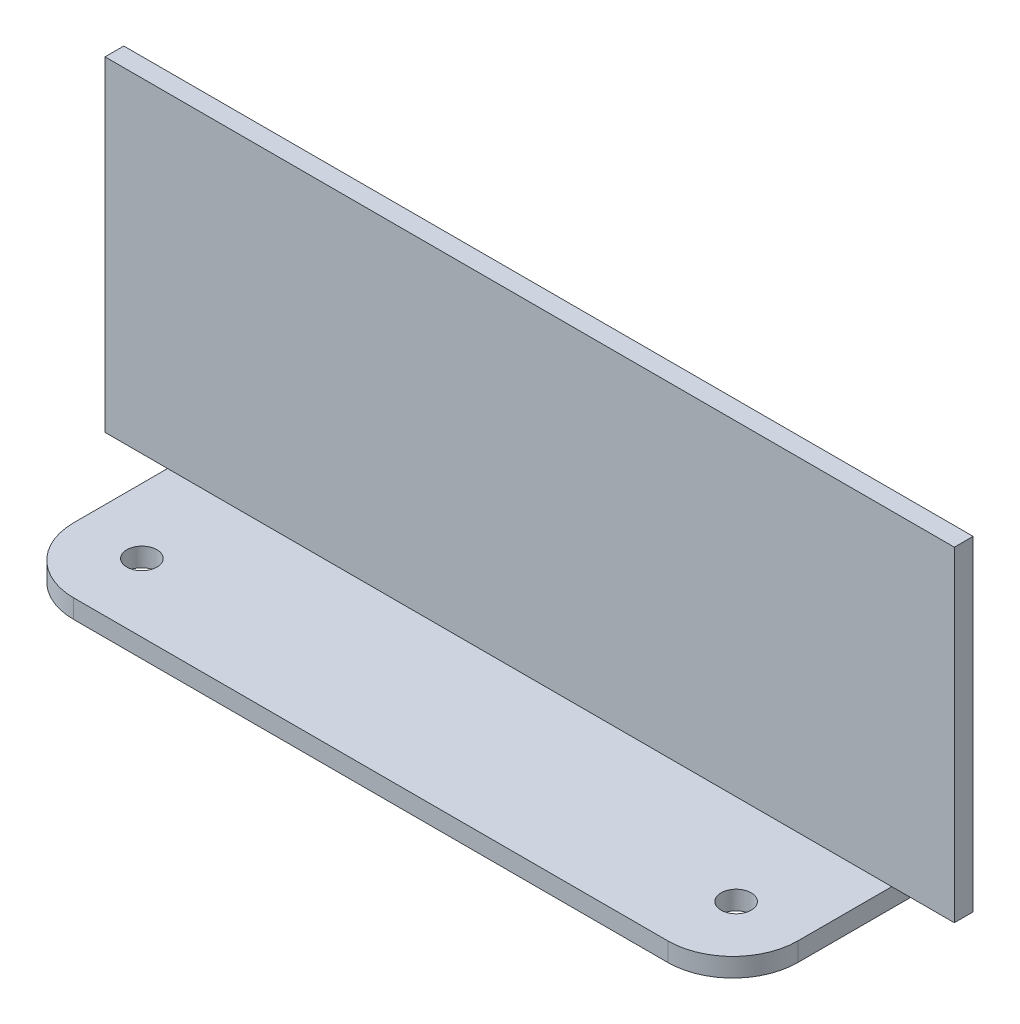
ISO-10303-21;
HEADER;
FILE_DESCRIPTION(('STEP AP214'),'2;1');
FILE_NAME('part.step','',(''),(''),'','','');
FILE_SCHEMA(('AUTOMOTIVE_DESIGN { 1 0 10303 214 1 1 1 1 }'));
ENDSEC;
DATA;
#1=APPLICATION_CONTEXT('core data for automotive mechanical design processes');
#2=APPLICATION_PROTOCOL_DEFINITION('international standard','automotive_design',2000,#1);
#3=PRODUCT_CONTEXT('',#1,'mechanical');
#4=PRODUCT('Part','Part','',(#3));
#5=PRODUCT_RELATED_PRODUCT_CATEGORY('part','',(#4));
#6=PRODUCT_DEFINITION_FORMATION('','',#4);
#7=PRODUCT_DEFINITION_CONTEXT('part definition',#1,'design');
#8=PRODUCT_DEFINITION('design','',#6,#7);
#9=PRODUCT_DEFINITION_SHAPE('','',#8);
#10=(LENGTH_UNIT() NAMED_UNIT(*) SI_UNIT(.MILLI.,.METRE.));
#11=(NAMED_UNIT(*) PLANE_ANGLE_UNIT() SI_UNIT($,.RADIAN.));
#12=(NAMED_UNIT(*) SI_UNIT($,.STERADIAN.) SOLID_ANGLE_UNIT());
#13=UNCERTAINTY_MEASURE_WITH_UNIT(LENGTH_MEASURE(1.E-05),#10,'distance_accuracy_value','');
#14=(GEOMETRIC_REPRESENTATION_CONTEXT(3) GLOBAL_UNCERTAINTY_ASSIGNED_CONTEXT((#13)) GLOBAL_UNIT_ASSIGNED_CONTEXT((#10,
#11,#12)) REPRESENTATION_CONTEXT('',''));
#15=CARTESIAN_POINT('',(0.,0.,0.));
#16=DIRECTION('',(0.,0.,1.));
#17=DIRECTION('',(1.,0.,0.));
#18=AXIS2_PLACEMENT_3D('',#15,#16,#17);
#19=CARTESIAN_POINT('',(115.78,3.,1.54497141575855E-12));
#20=DIRECTION('',(1.,0.,0.));
#21=DIRECTION('',(0.,0.,-1.));
#22=AXIS2_PLACEMENT_3D('',#19,#20,#21);
#23=PLANE('',#22);
#24=DIRECTION('',(0.,-1.,0.));
#25=VECTOR('',#24,1.);
#26=CARTESIAN_POINT('',(115.78,3.,-28.4099999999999));
#27=LINE('',#26,#25);
#28=CARTESIAN_POINT('',(115.78,3.,-28.4099999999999));
#29=VERTEX_POINT('',#28);
#30=CARTESIAN_POINT('',(115.78,0.,-28.4099999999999));
#31=VERTEX_POINT('',#30);
#32=EDGE_CURVE('E264',#29,#31,#27,.T.);
#33=ORIENTED_EDGE('',*,*,#32,.F.);
#34=DIRECTION('',(0.,0.,-1.));
#35=VECTOR('',#34,1.);
#36=CARTESIAN_POINT('',(115.78,3.,-25.41));
#37=LINE('',#36,#35);
#38=CARTESIAN_POINT('',(115.78,3.,-25.41));
#39=VERTEX_POINT('',#38);
#40=EDGE_CURVE('E164',#39,#29,#37,.T.);
#41=ORIENTED_EDGE('',*,*,#40,.F.);
#42=DIRECTION('',(0.,0.,1.));
#43=VECTOR('',#42,1.);
#44=CARTESIAN_POINT('',(115.78,3.,1.54497141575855E-12));
#45=LINE('',#44,#43);
#46=CARTESIAN_POINT('',(115.78,3.,-10.39));
#47=VERTEX_POINT('',#46);
#48=EDGE_CURVE('E211',#39,#47,#45,.T.);
#49=ORIENTED_EDGE('',*,*,#48,.T.);
#50=DIRECTION('',(0.,-1.,0.));
#51=VECTOR('',#50,1.);
#52=CARTESIAN_POINT('',(115.78,3.,-10.39));
#53=LINE('',#52,#51);
#54=CARTESIAN_POINT('',(115.78,0.,-10.39));
#55=VERTEX_POINT('',#54);
#56=EDGE_CURVE('E50',#47,#55,#53,.T.);
#57=ORIENTED_EDGE('',*,*,#56,.T.);
#58=DIRECTION('',(0.,0.,1.));
#59=VECTOR('',#58,1.);
#60=CARTESIAN_POINT('',(115.78,0.,1.54497141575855E-12));
#61=LINE('',#60,#59);
#62=EDGE_CURVE('E234',#31,#55,#61,.T.);
#63=ORIENTED_EDGE('',*,*,#62,.F.);
#64=EDGE_LOOP('',(#33,#41,#49,#57,#63));
#65=FACE_BOUND('',#64,.T.);
#66=ADVANCED_FACE('F41',(#65),#23,.T.);
#67=CARTESIAN_POINT('',(0.,3.,0.));
#68=DIRECTION('',(-1.,0.,0.));
#69=DIRECTION('',(0.,0.,1.));
#70=AXIS2_PLACEMENT_3D('',#67,#68,#69);
#71=PLANE('',#70);
#72=DIRECTION('',(0.,0.,-1.));
#73=VECTOR('',#72,1.);
#74=CARTESIAN_POINT('',(0.,3.,0.));
#75=LINE('',#74,#73);
#76=CARTESIAN_POINT('',(0.,3.,-10.3900000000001));
#77=VERTEX_POINT('',#76);
#78=CARTESIAN_POINT('',(0.,3.,-25.41));
#79=VERTEX_POINT('',#78);
#80=EDGE_CURVE('E214',#77,#79,#75,.T.);
#81=ORIENTED_EDGE('',*,*,#80,.T.);
#82=DIRECTION('',(0.,0.,1.));
#83=VECTOR('',#82,1.);
#84=CARTESIAN_POINT('',(0.,3.,-25.41));
#85=LINE('',#84,#83);
#86=CARTESIAN_POINT('',(0.,3.,-28.4099999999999));
#87=VERTEX_POINT('',#86);
#88=EDGE_CURVE('E57',#87,#79,#85,.T.);
#89=ORIENTED_EDGE('',*,*,#88,.F.);
#90=DIRECTION('',(0.,-1.,0.));
#91=VECTOR('',#90,1.);
#92=CARTESIAN_POINT('',(0.,3.,-28.4099999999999));
#93=LINE('',#92,#91);
#94=CARTESIAN_POINT('',(0.,0.,-28.4099999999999));
#95=VERTEX_POINT('',#94);
#96=EDGE_CURVE('E261',#87,#95,#93,.T.);
#97=ORIENTED_EDGE('',*,*,#96,.T.);
#98=DIRECTION('',(0.,0.,-1.));
#99=VECTOR('',#98,1.);
#100=CARTESIAN_POINT('',(0.,0.,0.));
#101=LINE('',#100,#99);
#102=CARTESIAN_POINT('',(0.,0.,-10.3900000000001));
#103=VERTEX_POINT('',#102);
#104=EDGE_CURVE('E241',#103,#95,#101,.T.);
#105=ORIENTED_EDGE('',*,*,#104,.F.);
#106=DIRECTION('',(0.,-1.,0.));
#107=VECTOR('',#106,1.);
#108=CARTESIAN_POINT('',(0.,3.,-10.3900000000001));
#109=LINE('',#108,#107);
#110=EDGE_CURVE('E258',#77,#103,#109,.T.);
#111=ORIENTED_EDGE('',*,*,#110,.F.);
#112=EDGE_LOOP('',(#81,#89,#97,#105,#111));
#113=FACE_BOUND('',#112,.T.);
#114=ADVANCED_FACE('F295',(#113),#71,.T.);
#115=CARTESIAN_POINT('',(0.,3.,0.));
#116=DIRECTION('',(0.,1.,0.));
#117=DIRECTION('',(0.,0.,1.));
#118=AXIS2_PLACEMENT_3D('',#115,#116,#117);
#119=PLANE('',#118);
#120=CARTESIAN_POINT('',(10.39,3.,-10.91));
#121=DIRECTION('',(0.,1.,0.));
#122=DIRECTION('',(0.,0.,1.));
#123=AXIS2_PLACEMENT_3D('',#120,#121,#122);
#124=CIRCLE('',#123,2.41);
#125=CARTESIAN_POINT('',(10.39,3.,-8.49999999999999));
#126=VERTEX_POINT('',#125);
#127=EDGE_CURVE('E220',#126,#126,#124,.T.);
#128=ORIENTED_EDGE('',*,*,#127,.F.);
#129=EDGE_LOOP('',(#128));
#130=FACE_BOUND('',#129,.T.);
#131=CARTESIAN_POINT('',(105.39,3.,-10.91));
#132=DIRECTION('',(0.,1.,0.));
#133=DIRECTION('',(0.,0.,1.));
#134=AXIS2_PLACEMENT_3D('',#131,#132,#133);
#135=CIRCLE('',#134,2.40999999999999);
#136=CARTESIAN_POINT('',(105.39,3.,-8.49999999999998));
#137=VERTEX_POINT('',#136);
#138=EDGE_CURVE('E224',#137,#137,#135,.F.);
#139=ORIENTED_EDGE('',*,*,#138,.T.);
#140=EDGE_LOOP('',(#139));
#141=FACE_BOUND('',#140,.T.);
#142=ORIENTED_EDGE('',*,*,#48,.F.);
#143=DIRECTION('',(-1.,0.,0.));
#144=VECTOR('',#143,1.);
#145=CARTESIAN_POINT('',(0.,3.,-25.41));
#146=LINE('',#145,#144);
#147=EDGE_CURVE('E201',#39,#79,#146,.T.);
#148=ORIENTED_EDGE('',*,*,#147,.T.);
#149=ORIENTED_EDGE('',*,*,#80,.F.);
#150=CARTESIAN_POINT('',(10.39,3.,-10.39));
#151=DIRECTION('',(0.,1.,0.));
#152=DIRECTION('',(0.,0.,1.));
#153=AXIS2_PLACEMENT_3D('',#150,#151,#152);
#154=CIRCLE('',#153,10.39);
#155=CARTESIAN_POINT('',(10.3900000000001,3.,0.));
#156=VERTEX_POINT('',#155);
#157=EDGE_CURVE('E217',#156,#77,#154,.F.);
#158=ORIENTED_EDGE('',*,*,#157,.F.);
#159=DIRECTION('',(1.,0.,0.));
#160=VECTOR('',#159,1.);
#161=CARTESIAN_POINT('',(0.,3.,0.));
#162=LINE('',#161,#160);
#163=CARTESIAN_POINT('',(105.39,3.,0.));
#164=VERTEX_POINT('',#163);
#165=EDGE_CURVE('E205',#156,#164,#162,.T.);
#166=ORIENTED_EDGE('',*,*,#165,.T.);
#167=CARTESIAN_POINT('',(105.39,3.,-10.39));
#168=DIRECTION('',(0.,1.,0.));
#169=DIRECTION('',(0.,0.,1.));
#170=AXIS2_PLACEMENT_3D('',#167,#168,#169);
#171=CIRCLE('',#170,10.39);
#172=EDGE_CURVE('E97',#164,#47,#171,.T.);
#173=ORIENTED_EDGE('',*,*,#172,.T.);
#174=EDGE_LOOP('',(#142,#148,#149,#158,#166,#173));
#175=FACE_BOUND('',#174,.T.);
#176=ADVANCED_FACE('F288',(#130,#141,#175),#119,.T.);
#177=CARTESIAN_POINT('',(0.,3.,0.));
#178=DIRECTION('',(0.,0.,-1.));
#179=DIRECTION('',(-1.,0.,0.));
#180=AXIS2_PLACEMENT_3D('',#177,#178,#179);
#181=PLANE('',#180);
#182=DIRECTION('',(1.,0.,0.));
#183=VECTOR('',#182,1.);
#184=CARTESIAN_POINT('',(0.,0.,0.));
#185=LINE('',#184,#183);
#186=CARTESIAN_POINT('',(10.3900000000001,0.,0.));
#187=VERTEX_POINT('',#186);
#188=CARTESIAN_POINT('',(105.39,0.,0.));
#189=VERTEX_POINT('',#188);
#190=EDGE_CURVE('E204',#187,#189,#185,.T.);
#191=ORIENTED_EDGE('',*,*,#190,.T.);
#192=DIRECTION('',(0.,-1.,0.));
#193=VECTOR('',#192,1.);
#194=CARTESIAN_POINT('',(105.39,3.,0.));
#195=LINE('',#194,#193);
#196=EDGE_CURVE('E11',#164,#189,#195,.T.);
#197=ORIENTED_EDGE('',*,*,#196,.F.);
#198=ORIENTED_EDGE('',*,*,#165,.F.);
#199=DIRECTION('',(0.,-1.,0.));
#200=VECTOR('',#199,1.);
#201=CARTESIAN_POINT('',(10.3900000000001,3.,0.));
#202=LINE('',#201,#200);
#203=EDGE_CURVE('E66',#156,#187,#202,.T.);
#204=ORIENTED_EDGE('',*,*,#203,.T.);
#205=EDGE_LOOP('',(#191,#197,#198,#204));
#206=FACE_BOUND('',#205,.T.);
#207=ADVANCED_FACE('F43',(#206),#181,.F.);
#208=CARTESIAN_POINT('',(105.39,3.,-10.39));
#209=DIRECTION('',(0.,-1.,0.));
#210=DIRECTION('',(0.,0.,-1.));
#211=AXIS2_PLACEMENT_3D('',#208,#209,#210);
#212=CYLINDRICAL_SURFACE('',#211,10.39);
#213=CARTESIAN_POINT('',(105.39,0.,-10.39));
#214=DIRECTION('',(0.,1.,0.));
#215=DIRECTION('',(0.,0.,1.));
#216=AXIS2_PLACEMENT_3D('',#213,#214,#215);
#217=CIRCLE('',#216,10.39);
#218=EDGE_CURVE('E230',#189,#55,#217,.T.);
#219=ORIENTED_EDGE('',*,*,#218,.T.);
#220=ORIENTED_EDGE('',*,*,#56,.F.);
#221=ORIENTED_EDGE('',*,*,#172,.F.);
#222=ORIENTED_EDGE('',*,*,#196,.T.);
#223=EDGE_LOOP('',(#219,#220,#221,#222));
#224=FACE_BOUND('',#223,.T.);
#225=ADVANCED_FACE('F273',(#224),#212,.T.);
#226=CARTESIAN_POINT('',(0.,3.,-28.4099999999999));
#227=DIRECTION('',(0.,0.,-1.));
#228=DIRECTION('',(-1.,0.,0.));
#229=AXIS2_PLACEMENT_3D('',#226,#227,#228);
#230=PLANE('',#229);
#231=DIRECTION('',(1.,0.,0.));
#232=VECTOR('',#231,1.);
#233=CARTESIAN_POINT('',(0.,0.,-28.4099999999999));
#234=LINE('',#233,#232);
#235=EDGE_CURVE('E237',#95,#31,#234,.T.);
#236=ORIENTED_EDGE('',*,*,#235,.F.);
#237=ORIENTED_EDGE('',*,*,#96,.F.);
#238=DIRECTION('',(1.,0.,0.));
#239=VECTOR('',#238,1.);
#240=CARTESIAN_POINT('',(-10.,3.,-28.4099999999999));
#241=LINE('',#240,#239);
#242=CARTESIAN_POINT('',(-10.,3.,-28.4099999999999));
#243=VERTEX_POINT('',#242);
#244=EDGE_CURVE('E147',#243,#87,#241,.T.);
#245=ORIENTED_EDGE('',*,*,#244,.F.);
#246=DIRECTION('',(0.,-1.,0.));
#247=VECTOR('',#246,1.);
#248=CARTESIAN_POINT('',(-10.,3.,-28.4099999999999));
#249=LINE('',#248,#247);
#250=CARTESIAN_POINT('',(-10.,55.,-28.4099999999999));
#251=VERTEX_POINT('',#250);
#252=EDGE_CURVE('E184',#251,#243,#249,.T.);
#253=ORIENTED_EDGE('',*,*,#252,.F.);
#254=DIRECTION('',(1.,0.,0.));
#255=VECTOR('',#254,1.);
#256=CARTESIAN_POINT('',(0.,55.,-28.4099999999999));
#257=LINE('',#256,#255);
#258=CARTESIAN_POINT('',(125.78,55.,-28.4099999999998));
#259=VERTEX_POINT('',#258);
#260=EDGE_CURVE('E146',#251,#259,#257,.T.);
#261=ORIENTED_EDGE('',*,*,#260,.T.);
#262=DIRECTION('',(0.,1.,0.));
#263=VECTOR('',#262,1.);
#264=CARTESIAN_POINT('',(125.78,3.,-28.4099999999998));
#265=LINE('',#264,#263);
#266=CARTESIAN_POINT('',(125.78,3.,-28.4099999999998));
#267=VERTEX_POINT('',#266);
#268=EDGE_CURVE('E162',#267,#259,#265,.T.);
#269=ORIENTED_EDGE('',*,*,#268,.F.);
#270=DIRECTION('',(-1.,0.,0.));
#271=VECTOR('',#270,1.);
#272=CARTESIAN_POINT('',(125.78,3.,-28.4099999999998));
#273=LINE('',#272,#271);
#274=EDGE_CURVE('E172',#267,#29,#273,.T.);
#275=ORIENTED_EDGE('',*,*,#274,.T.);
#276=ORIENTED_EDGE('',*,*,#32,.T.);
#277=EDGE_LOOP('',(#236,#237,#245,#253,#261,#269,#275,#276));
#278=FACE_BOUND('',#277,.T.);
#279=ADVANCED_FACE('F281',(#278),#230,.T.);
#280=CARTESIAN_POINT('',(10.39,3.,-10.91));
#281=DIRECTION('',(0.,-1.,0.));
#282=DIRECTION('',(0.,0.,-1.));
#283=AXIS2_PLACEMENT_3D('',#280,#281,#282);
#284=CYLINDRICAL_SURFACE('',#283,2.41);
#285=ORIENTED_EDGE('',*,*,#127,.T.);
#286=EDGE_LOOP('',(#285));
#287=FACE_BOUND('',#286,.T.);
#288=CARTESIAN_POINT('',(10.39,0.,-10.91));
#289=DIRECTION('',(0.,1.,0.));
#290=DIRECTION('',(0.,0.,1.));
#291=AXIS2_PLACEMENT_3D('',#288,#289,#290);
#292=CIRCLE('',#291,2.41);
#293=CARTESIAN_POINT('',(10.39,0.,-8.49999999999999));
#294=VERTEX_POINT('',#293);
#295=EDGE_CURVE('E249',#294,#294,#292,.T.);
#296=ORIENTED_EDGE('',*,*,#295,.F.);
#297=EDGE_LOOP('',(#296));
#298=FACE_BOUND('',#297,.T.);
#299=ADVANCED_FACE('F307',(#287,#298),#284,.F.);
#300=CARTESIAN_POINT('',(10.39,3.,-10.39));
#301=DIRECTION('',(0.,-1.,0.));
#302=DIRECTION('',(0.,0.,-1.));
#303=AXIS2_PLACEMENT_3D('',#300,#301,#302);
#304=CYLINDRICAL_SURFACE('',#303,10.39);
#305=CARTESIAN_POINT('',(10.39,0.,-10.39));
#306=DIRECTION('',(0.,1.,0.));
#307=DIRECTION('',(0.,0.,1.));
#308=AXIS2_PLACEMENT_3D('',#305,#306,#307);
#309=CIRCLE('',#308,10.39);
#310=EDGE_CURVE('E245',#187,#103,#309,.F.);
#311=ORIENTED_EDGE('',*,*,#310,.F.);
#312=ORIENTED_EDGE('',*,*,#203,.F.);
#313=ORIENTED_EDGE('',*,*,#157,.T.);
#314=ORIENTED_EDGE('',*,*,#110,.T.);
#315=EDGE_LOOP('',(#311,#312,#313,#314));
#316=FACE_BOUND('',#315,.T.);
#317=ADVANCED_FACE('F309',(#316),#304,.T.);
#318=CARTESIAN_POINT('',(105.39,3.,-10.91));
#319=DIRECTION('',(0.,-1.,0.));
#320=DIRECTION('',(0.,0.,-1.));
#321=AXIS2_PLACEMENT_3D('',#318,#319,#320);
#322=CYLINDRICAL_SURFACE('',#321,2.40999999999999);
#323=ORIENTED_EDGE('',*,*,#138,.F.);
#324=EDGE_LOOP('',(#323));
#325=FACE_BOUND('',#324,.T.);
#326=CARTESIAN_POINT('',(105.39,0.,-10.91));
#327=DIRECTION('',(0.,1.,0.));
#328=DIRECTION('',(0.,0.,1.));
#329=AXIS2_PLACEMENT_3D('',#326,#327,#328);
#330=CIRCLE('',#329,2.40999999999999);
#331=CARTESIAN_POINT('',(105.39,0.,-8.49999999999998));
#332=VERTEX_POINT('',#331);
#333=EDGE_CURVE('E208',#332,#332,#330,.F.);
#334=ORIENTED_EDGE('',*,*,#333,.T.);
#335=EDGE_LOOP('',(#334));
#336=FACE_BOUND('',#335,.T.);
#337=ADVANCED_FACE('F312',(#325,#336),#322,.F.);
#338=CARTESIAN_POINT('',(0.,0.,0.));
#339=DIRECTION('',(0.,1.,0.));
#340=DIRECTION('',(0.,0.,1.));
#341=AXIS2_PLACEMENT_3D('',#338,#339,#340);
#342=PLANE('',#341);
#343=ORIENTED_EDGE('',*,*,#62,.T.);
#344=ORIENTED_EDGE('',*,*,#218,.F.);
#345=ORIENTED_EDGE('',*,*,#190,.F.);
#346=ORIENTED_EDGE('',*,*,#310,.T.);
#347=ORIENTED_EDGE('',*,*,#104,.T.);
#348=ORIENTED_EDGE('',*,*,#235,.T.);
#349=EDGE_LOOP('',(#343,#344,#345,#346,#347,#348));
#350=FACE_BOUND('',#349,.T.);
#351=ORIENTED_EDGE('',*,*,#333,.F.);
#352=EDGE_LOOP('',(#351));
#353=FACE_BOUND('',#352,.T.);
#354=ORIENTED_EDGE('',*,*,#295,.T.);
#355=EDGE_LOOP('',(#354));
#356=FACE_BOUND('',#355,.T.);
#357=ADVANCED_FACE('F276',(#350,#353,#356),#342,.F.);
#358=CARTESIAN_POINT('',(0.,55.,-25.41));
#359=DIRECTION('',(0.,0.,-1.));
#360=DIRECTION('',(-1.,0.,0.));
#361=AXIS2_PLACEMENT_3D('',#358,#359,#360);
#362=PLANE('',#361);
#363=ORIENTED_EDGE('',*,*,#147,.F.);
#364=DIRECTION('',(-1.,0.,0.));
#365=VECTOR('',#364,1.);
#366=CARTESIAN_POINT('',(125.78,3.,-25.4099999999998));
#367=LINE('',#366,#365);
#368=CARTESIAN_POINT('',(125.78,3.,-25.4099999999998));
#369=VERTEX_POINT('',#368);
#370=EDGE_CURVE('E153',#369,#39,#367,.T.);
#371=ORIENTED_EDGE('',*,*,#370,.F.);
#372=DIRECTION('',(0.,-1.,0.));
#373=VECTOR('',#372,1.);
#374=CARTESIAN_POINT('',(125.78,55.,-25.4099999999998));
#375=LINE('',#374,#373);
#376=CARTESIAN_POINT('',(125.78,55.,-25.4099999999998));
#377=VERTEX_POINT('',#376);
#378=EDGE_CURVE('E150',#377,#369,#375,.T.);
#379=ORIENTED_EDGE('',*,*,#378,.F.);
#380=DIRECTION('',(1.,0.,0.));
#381=VECTOR('',#380,1.);
#382=CARTESIAN_POINT('',(0.,55.,-25.41));
#383=LINE('',#382,#381);
#384=CARTESIAN_POINT('',(-10.,55.,-25.41));
#385=VERTEX_POINT('',#384);
#386=EDGE_CURVE('E135',#385,#377,#383,.T.);
#387=ORIENTED_EDGE('',*,*,#386,.F.);
#388=DIRECTION('',(0.,1.,0.));
#389=VECTOR('',#388,1.);
#390=CARTESIAN_POINT('',(-10.,55.,-25.41));
#391=LINE('',#390,#389);
#392=CARTESIAN_POINT('',(-10.,3.,-25.41));
#393=VERTEX_POINT('',#392);
#394=EDGE_CURVE('E179',#393,#385,#391,.T.);
#395=ORIENTED_EDGE('',*,*,#394,.F.);
#396=DIRECTION('',(1.,0.,0.));
#397=VECTOR('',#396,1.);
#398=CARTESIAN_POINT('',(-10.,3.,-25.41));
#399=LINE('',#398,#397);
#400=EDGE_CURVE('E190',#393,#79,#399,.T.);
#401=ORIENTED_EDGE('',*,*,#400,.T.);
#402=EDGE_LOOP('',(#363,#371,#379,#387,#395,#401));
#403=FACE_BOUND('',#402,.T.);
#404=ADVANCED_FACE('F152',(#403),#362,.F.);
#405=CARTESIAN_POINT('',(0.,55.,0.));
#406=DIRECTION('',(0.,1.,0.));
#407=DIRECTION('',(0.,0.,1.));
#408=AXIS2_PLACEMENT_3D('',#405,#406,#407);
#409=PLANE('',#408);
#410=ORIENTED_EDGE('',*,*,#386,.T.);
#411=DIRECTION('',(0.,0.,1.));
#412=VECTOR('',#411,1.);
#413=CARTESIAN_POINT('',(125.78,55.,-28.4099999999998));
#414=LINE('',#413,#412);
#415=EDGE_CURVE('E139',#259,#377,#414,.T.);
#416=ORIENTED_EDGE('',*,*,#415,.F.);
#417=ORIENTED_EDGE('',*,*,#260,.F.);
#418=DIRECTION('',(0.,0.,-1.));
#419=VECTOR('',#418,1.);
#420=CARTESIAN_POINT('',(-10.,55.,-28.4099999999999));
#421=LINE('',#420,#419);
#422=EDGE_CURVE('E141',#385,#251,#421,.T.);
#423=ORIENTED_EDGE('',*,*,#422,.F.);
#424=EDGE_LOOP('',(#410,#416,#417,#423));
#425=FACE_BOUND('',#424,.T.);
#426=ADVANCED_FACE('F137',(#425),#409,.T.);
#427=CARTESIAN_POINT('',(-10.,3.,-25.41));
#428=DIRECTION('',(0.,1.,0.));
#429=DIRECTION('',(0.,0.,1.));
#430=AXIS2_PLACEMENT_3D('',#427,#428,#429);
#431=PLANE('',#430);
#432=ORIENTED_EDGE('',*,*,#88,.T.);
#433=ORIENTED_EDGE('',*,*,#400,.F.);
#434=DIRECTION('',(0.,0.,1.));
#435=VECTOR('',#434,1.);
#436=CARTESIAN_POINT('',(-10.,3.,-25.41));
#437=LINE('',#436,#435);
#438=EDGE_CURVE('E187',#243,#393,#437,.T.);
#439=ORIENTED_EDGE('',*,*,#438,.F.);
#440=ORIENTED_EDGE('',*,*,#244,.T.);
#441=EDGE_LOOP('',(#432,#433,#439,#440));
#442=FACE_BOUND('',#441,.T.);
#443=ADVANCED_FACE('F325',(#442),#431,.F.);
#444=CARTESIAN_POINT('',(-10.,0.,0.));
#445=DIRECTION('',(1.,0.,0.));
#446=DIRECTION('',(0.,0.,-1.));
#447=AXIS2_PLACEMENT_3D('',#444,#445,#446);
#448=PLANE('',#447);
#449=ORIENTED_EDGE('',*,*,#394,.T.);
#450=ORIENTED_EDGE('',*,*,#422,.T.);
#451=ORIENTED_EDGE('',*,*,#252,.T.);
#452=ORIENTED_EDGE('',*,*,#438,.T.);
#453=EDGE_LOOP('',(#449,#450,#451,#452));
#454=FACE_BOUND('',#453,.T.);
#455=ADVANCED_FACE('F328',(#454),#448,.F.);
#456=CARTESIAN_POINT('',(125.78,3.,-25.4099999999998));
#457=DIRECTION('',(0.,1.,0.));
#458=DIRECTION('',(0.,0.,1.));
#459=AXIS2_PLACEMENT_3D('',#456,#457,#458);
#460=PLANE('',#459);
#461=ORIENTED_EDGE('',*,*,#40,.T.);
#462=ORIENTED_EDGE('',*,*,#274,.F.);
#463=DIRECTION('',(0.,0.,-1.));
#464=VECTOR('',#463,1.);
#465=CARTESIAN_POINT('',(125.78,3.,-25.4099999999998));
#466=LINE('',#465,#464);
#467=EDGE_CURVE('E157',#369,#267,#466,.T.);
#468=ORIENTED_EDGE('',*,*,#467,.F.);
#469=ORIENTED_EDGE('',*,*,#370,.T.);
#470=EDGE_LOOP('',(#461,#462,#468,#469));
#471=FACE_BOUND('',#470,.T.);
#472=ADVANCED_FACE('F332',(#471),#460,.F.);
#473=CARTESIAN_POINT('',(125.78,0.,1.74021053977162E-12));
#474=DIRECTION('',(1.,0.,0.));
#475=DIRECTION('',(0.,0.,-1.));
#476=AXIS2_PLACEMENT_3D('',#473,#474,#475);
#477=PLANE('',#476);
#478=ORIENTED_EDGE('',*,*,#415,.T.);
#479=ORIENTED_EDGE('',*,*,#378,.T.);
#480=ORIENTED_EDGE('',*,*,#467,.T.);
#481=ORIENTED_EDGE('',*,*,#268,.T.);
#482=EDGE_LOOP('',(#478,#479,#480,#481));
#483=FACE_BOUND('',#482,.T.);
#484=ADVANCED_FACE('F160',(#483),#477,.T.);
#485=CLOSED_SHELL('',(#66,#114,#176,#207,#225,#279,#299,#317,#337,#357,#404,#426,#443,#455,#472,#484));
#486=MANIFOLD_SOLID_BREP('B2',#485);
#487=ADVANCED_BREP_SHAPE_REPRESENTATION('',(#18,#486),#14);
#488=SHAPE_DEFINITION_REPRESENTATION(#9,#487);
ENDSEC;
END-ISO-10303-21;
